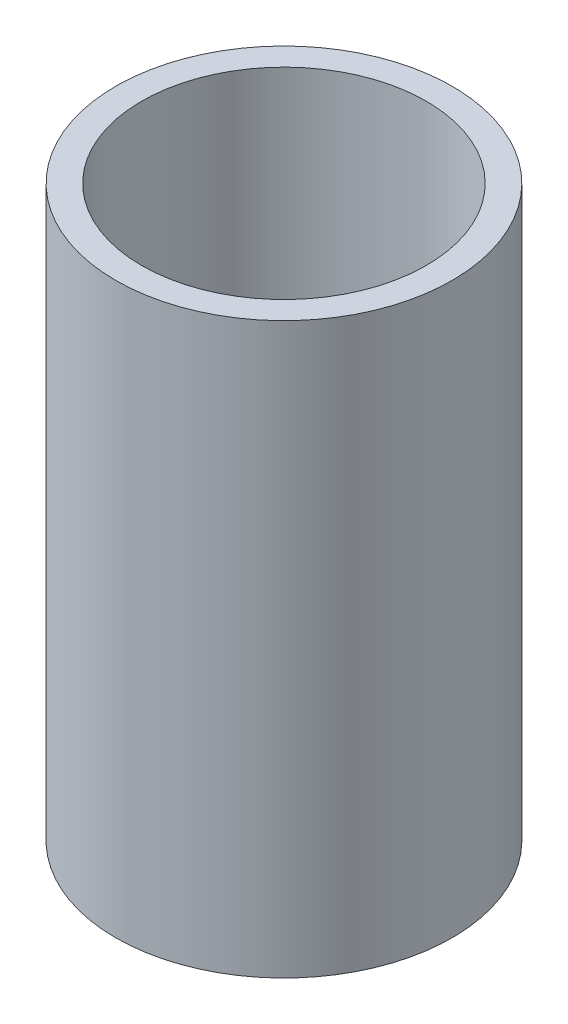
from build123d import *

# Parameters (mm, degrees)
SKETCH1_R           = 3.25
BOSS_EXTRUDE1_DEPTH = 11
SKETCH2_R           = 2.75
CUT_EXTRUDE2_DEPTH  = 11


with BuildPart() as part:
    # Sketch1 → Boss-Extrude1 (new body)
    with BuildSketch(Plane(origin=(0, 0, 0), x_dir=(1, 0, 0), z_dir=(0, 1, 0))):
        with Locations(Location((0, 0, 0), (0, 0, 270))):
            Circle(SKETCH1_R)
    extrude(amount=BOSS_EXTRUDE1_DEPTH)

    # Sketch2 → Cut-Extrude2 (cut)
    with BuildSketch(Plane(origin=(0, 11, 0), x_dir=(1, 0, 0), z_dir=(0, 1, 0))):
        with Locations(Location((0, 0, 0), (0, 0, 270))):
            Circle(SKETCH2_R)
    extrude(amount=-CUT_EXTRUDE2_DEPTH, mode=Mode.SUBTRACT)


solid = part.part
